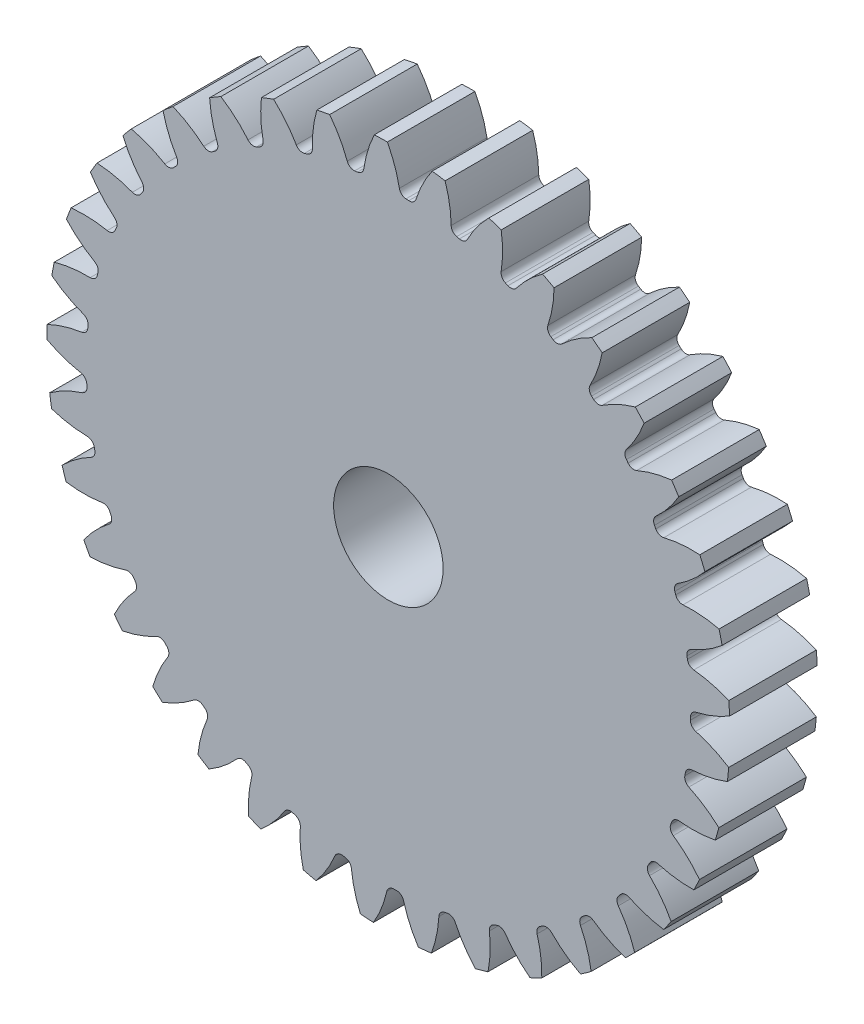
from build123d import *

# Parameters (mm, degrees)
SKETCH3_R         = 396.24
GEARBODY_DEPTH    = 101.6
TOOTHCUT_DEPTH    = 570.504025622
CIRPATTERN1_COUNT = 37
BOREDIA_R         = 63.5
BORE_DEPTH        = 12700


with BuildPart() as part:
    # Sketch3 → gearBody (new body)
    with BuildSketch(Plane.XY):
        Circle(SKETCH3_R)
    extrude(amount=GEARBODY_DEPTH)

    # Sketch2 → toothCut (cut, through all)
    with BuildSketch(Plane.XY):
        with BuildLine():
            ThreePointArc((350.410801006, -8.748767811), (350.447502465, -7.128703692), (350.476713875, -5.508487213))
            ThreePointArc((350.476713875, -5.508487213), (352.316420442, -0.436701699), (356.892322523, 2.421383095))
            ThreePointArc((356.892322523, 2.421383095), (377.185689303, 8.792319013), (396.24, 18.244451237))
            ThreePointArc((396.24, 18.244451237), (396.577760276, -8.067072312), (395.170279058, -34.343094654))
            ThreePointArc((395.170279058, -34.343094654), (376.516116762, -24.123907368), (356.498621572, -16.93297933))
            ThreePointArc((356.498621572, -16.93297933), (352.042733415, -13.89117242), (350.410801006, -8.748767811))
        make_face()
    toothcut = extrude(amount=TOOTHCUT_DEPTH, mode=Mode.SUBTRACT)

    # CirPattern1: toothCut ×37 about axis
    cirpattern1_axis = Axis((0, 0, 0), (0, 0, 1))
    for i in range(1, CIRPATTERN1_COUNT):
        add(toothcut.rotate(cirpattern1_axis, i * 360 / CIRPATTERN1_COUNT), mode=Mode.SUBTRACT)

    # boreDia → bore (cut, symmetric)
    with BuildSketch(Plane.XY):
        Circle(BOREDIA_R)
    extrude(amount=BORE_DEPTH, both=True, mode=Mode.SUBTRACT)


solid = part.part
